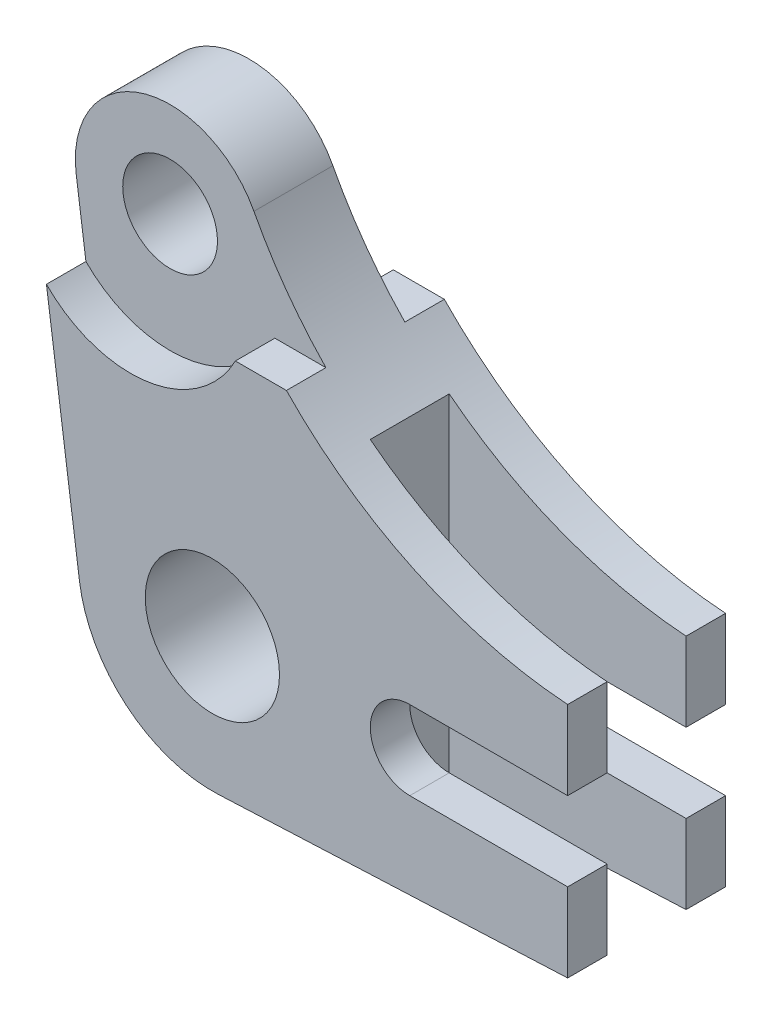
from build123d import *

# Parameters (mm, degrees)
SKETCH2_R           = 10.795
SKETCH2_R_2         = 7.62
BOSS_EXTRUDE1_DEPTH = 12.7
CUT_EXTRUDE1_DEPTH  = 6.35
SKETCH4_W           = 12.7
SKETCH4_H           = 61.747375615
CUT_EXTRUDE2_DEPTH  = 38.1


with BuildPart() as part:
    # Sketch2 → Boss-Extrude1 (new, symmetric)
    with BuildSketch(Plane.XY):
        with BuildLine():
            Line((31.75, 6.35), (57.15, 6.35))
            Line((57.15, 6.35), (57.15, 19.05))
            ThreePointArc((57.15, 19.05), (23.931755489, 30.246820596), (0.336044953, 56.170998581))
            ThreePointArc((0.336044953, 56.170998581), (-17.806138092, 63.579697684), (-28.246309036, 46.995655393))
            Line((-28.246309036, 46.995655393), (-21.389260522, -2.937283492))
            ThreePointArc((-21.389260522, -2.937283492), (-13.822032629, -16.585521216), (0.966774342, -21.56834364))
            Line((0.966774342, -21.56834364), (57.15, -19.05))
            Line((57.15, -19.05), (57.15, -6.35))
            Line((57.15, -6.35), (31.75, -6.35))
            ThreePointArc((31.75, -6.35), (25.4, 0), (31.75, 6.35))
        make_face()
        Circle(SKETCH2_R, mode=Mode.SUBTRACT)
        with Locations((-13.148007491, 49.069031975)):
            Circle(SKETCH2_R_2, mode=Mode.SUBTRACT)
    extrude(amount=BOSS_EXTRUDE1_DEPTH, both=True)

    # Sketch3 → Cut-Extrude1 (cut)
    with BuildSketch(Plane.XY.offset(12.7)):
        with BuildLine():
            Line((-28.246309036, 46.995655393), (-26.6912766, 35.671929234))
            ThreePointArc((-26.6912766, 35.671929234), (-10.353449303, 30.225121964), (3.700446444, 40.179031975))
            Line((3.700446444, 40.179031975), (11.912122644, 40.179031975))
            ThreePointArc((11.912122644, 40.179031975), (5.556248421, 47.763977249), (0.336044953, 56.170998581))
            ThreePointArc((0.336044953, 56.170998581), (-17.806138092, 63.579697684), (-28.246309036, 46.995655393))
        make_face()
    cut_extrude1 = extrude(amount=-CUT_EXTRUDE1_DEPTH, mode=Mode.SUBTRACT)

    # Mirror1: Cut-Extrude1 across plane
    add(cut_extrude1.mirror(Plane.XY), mode=Mode.SUBTRACT)

    # Sketch4 → Cut-Extrude2 (cut)
    with BuildSketch(Plane(origin=(57.15, 0, 0), x_dir=(0, 0, -1), z_dir=(1, 0, 0))):
        with Locations((0, 9.305344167)):
            Rectangle(SKETCH4_W, SKETCH4_H)
    extrude(amount=-CUT_EXTRUDE2_DEPTH, mode=Mode.SUBTRACT)


solid = part.part
